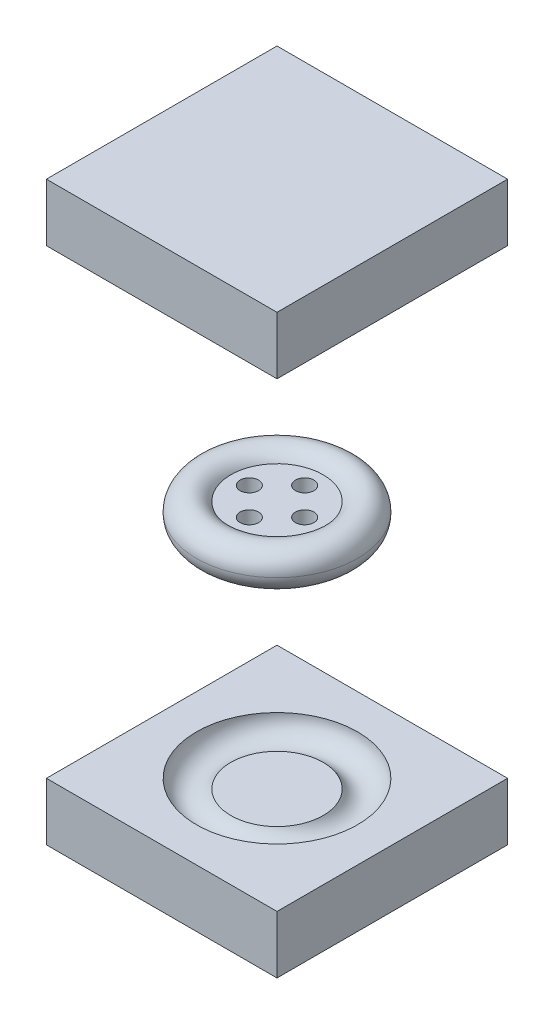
ISO-10303-21;
HEADER;
FILE_DESCRIPTION(('STEP AP214'),'2;1');
FILE_NAME('part.step','',(''),(''),'','','');
FILE_SCHEMA(('AUTOMOTIVE_DESIGN { 1 0 10303 214 1 1 1 1 }'));
ENDSEC;
DATA;
#1=APPLICATION_CONTEXT('core data for automotive mechanical design processes');
#2=APPLICATION_PROTOCOL_DEFINITION('international standard','automotive_design',2000,#1);
#3=PRODUCT_CONTEXT('',#1,'mechanical');
#4=PRODUCT('Part','Part','',(#3));
#5=PRODUCT_RELATED_PRODUCT_CATEGORY('part','',(#4));
#6=PRODUCT_DEFINITION_FORMATION('','',#4);
#7=PRODUCT_DEFINITION_CONTEXT('part definition',#1,'design');
#8=PRODUCT_DEFINITION('design','',#6,#7);
#9=PRODUCT_DEFINITION_SHAPE('','',#8);
#10=(LENGTH_UNIT() NAMED_UNIT(*) SI_UNIT(.MILLI.,.METRE.));
#11=(NAMED_UNIT(*) PLANE_ANGLE_UNIT() SI_UNIT($,.RADIAN.));
#12=(NAMED_UNIT(*) SI_UNIT($,.STERADIAN.) SOLID_ANGLE_UNIT());
#13=UNCERTAINTY_MEASURE_WITH_UNIT(LENGTH_MEASURE(1.E-05),#10,'distance_accuracy_value','');
#14=(GEOMETRIC_REPRESENTATION_CONTEXT(3) GLOBAL_UNCERTAINTY_ASSIGNED_CONTEXT((#13)) GLOBAL_UNIT_ASSIGNED_CONTEXT((#10,
#11,#12)) REPRESENTATION_CONTEXT('',''));
#15=CARTESIAN_POINT('',(0.,0.,0.));
#16=DIRECTION('',(0.,0.,1.));
#17=DIRECTION('',(1.,0.,0.));
#18=AXIS2_PLACEMENT_3D('',#15,#16,#17);
#19=CARTESIAN_POINT('',(0.,-104.,0.));
#20=DIRECTION('',(0.,1.,0.));
#21=DIRECTION('',(0.,0.,1.));
#22=AXIS2_PLACEMENT_3D('',#19,#20,#21);
#23=PLANE('',#22);
#24=CARTESIAN_POINT('',(0.,-104.,0.));
#25=DIRECTION('',(0.,-1.,0.));
#26=DIRECTION('',(0.,0.,-1.));
#27=AXIS2_PLACEMENT_3D('',#24,#25,#26);
#28=CIRCLE('',#27,20.);
#29=CARTESIAN_POINT('',(0.,-104.,-20.));
#30=VERTEX_POINT('',#29);
#31=EDGE_CURVE('E202',#30,#30,#28,.T.);
#32=ORIENTED_EDGE('',*,*,#31,.F.);
#33=EDGE_LOOP('',(#32));
#34=FACE_BOUND('',#33,.T.);
#35=ADVANCED_FACE('F129',(#34),#23,.T.);
#36=CARTESIAN_POINT('',(0.,-100.,0.));
#37=DIRECTION('',(0.,-1.,0.));
#38=DIRECTION('',(0.,0.,-1.));
#39=AXIS2_PLACEMENT_3D('',#36,#37,#38);
#40=TOROIDAL_SURFACE('',#39,26.9282032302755,8.);
#41=ORIENTED_EDGE('',*,*,#31,.T.);
#42=EDGE_LOOP('',(#41));
#43=FACE_BOUND('',#42,.T.);
#44=CARTESIAN_POINT('',(0.,-100.,0.));
#45=DIRECTION('',(0.,-1.,0.));
#46=DIRECTION('',(0.,0.,-1.));
#47=AXIS2_PLACEMENT_3D('',#44,#45,#46);
#48=CIRCLE('',#47,34.9282032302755);
#49=CARTESIAN_POINT('',(0.,-100.,-34.9282032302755));
#50=VERTEX_POINT('',#49);
#51=EDGE_CURVE('E195',#50,#50,#48,.T.);
#52=ORIENTED_EDGE('',*,*,#51,.F.);
#53=EDGE_LOOP('',(#52));
#54=FACE_BOUND('',#53,.T.);
#55=ADVANCED_FACE('F223',(#43,#54),#40,.F.);
#56=CARTESIAN_POINT('',(-0.725366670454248,-100.,-34.9282043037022));
#57=DIRECTION('',(0.,1.,0.));
#58=DIRECTION('',(0.999999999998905,0.,1.47984010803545E-06));
#59=AXIS2_PLACEMENT_3D('',#56,#57,#58);
#60=PLANE('',#59);
#61=DIRECTION('',(0.,0.,1.));
#62=VECTOR('',#61,1.);
#63=CARTESIAN_POINT('',(50.,-100.,-50.));
#64=LINE('',#63,#62);
#65=CARTESIAN_POINT('',(50.,-100.,-50.));
#66=VERTEX_POINT('',#65);
#67=CARTESIAN_POINT('',(50.,-100.,50.));
#68=VERTEX_POINT('',#67);
#69=EDGE_CURVE('E140',#66,#68,#64,.T.);
#70=ORIENTED_EDGE('',*,*,#69,.F.);
#71=DIRECTION('',(1.,0.,0.));
#72=VECTOR('',#71,1.);
#73=CARTESIAN_POINT('',(-50.,-100.,-50.));
#74=LINE('',#73,#72);
#75=CARTESIAN_POINT('',(-50.,-100.,-50.));
#76=VERTEX_POINT('',#75);
#77=EDGE_CURVE('E163',#76,#66,#74,.T.);
#78=ORIENTED_EDGE('',*,*,#77,.F.);
#79=DIRECTION('',(0.,0.,-1.));
#80=VECTOR('',#79,1.);
#81=CARTESIAN_POINT('',(-50.,-100.,-50.));
#82=LINE('',#81,#80);
#83=CARTESIAN_POINT('',(-50.,-100.,50.));
#84=VERTEX_POINT('',#83);
#85=EDGE_CURVE('E168',#84,#76,#82,.T.);
#86=ORIENTED_EDGE('',*,*,#85,.F.);
#87=DIRECTION('',(-1.,0.,0.));
#88=VECTOR('',#87,1.);
#89=CARTESIAN_POINT('',(-50.,-100.,50.));
#90=LINE('',#89,#88);
#91=EDGE_CURVE('E183',#68,#84,#90,.T.);
#92=ORIENTED_EDGE('',*,*,#91,.F.);
#93=EDGE_LOOP('',(#70,#78,#86,#92));
#94=FACE_BOUND('',#93,.T.);
#95=ORIENTED_EDGE('',*,*,#51,.T.);
#96=EDGE_LOOP('',(#95));
#97=FACE_BOUND('',#96,.T.);
#98=ADVANCED_FACE('F131',(#94,#97),#60,.T.);
#99=CARTESIAN_POINT('',(0.,-125.,0.));
#100=DIRECTION('',(0.,1.,0.));
#101=DIRECTION('',(0.,0.,1.));
#102=AXIS2_PLACEMENT_3D('',#99,#100,#101);
#103=PLANE('',#102);
#104=DIRECTION('',(0.,0.,1.));
#105=VECTOR('',#104,1.);
#106=CARTESIAN_POINT('',(50.,-125.,-50.));
#107=LINE('',#106,#105);
#108=CARTESIAN_POINT('',(50.,-125.,-50.));
#109=VERTEX_POINT('',#108);
#110=CARTESIAN_POINT('',(50.,-125.,50.));
#111=VERTEX_POINT('',#110);
#112=EDGE_CURVE('E193',#109,#111,#107,.T.);
#113=ORIENTED_EDGE('',*,*,#112,.T.);
#114=DIRECTION('',(-1.,0.,0.));
#115=VECTOR('',#114,1.);
#116=CARTESIAN_POINT('',(-50.,-125.,50.));
#117=LINE('',#116,#115);
#118=CARTESIAN_POINT('',(-50.,-125.,50.));
#119=VERTEX_POINT('',#118);
#120=EDGE_CURVE('E181',#111,#119,#117,.T.);
#121=ORIENTED_EDGE('',*,*,#120,.T.);
#122=DIRECTION('',(0.,0.,-1.));
#123=VECTOR('',#122,1.);
#124=CARTESIAN_POINT('',(-50.,-125.,-50.));
#125=LINE('',#124,#123);
#126=CARTESIAN_POINT('',(-50.,-125.,-50.));
#127=VERTEX_POINT('',#126);
#128=EDGE_CURVE('E185',#119,#127,#125,.T.);
#129=ORIENTED_EDGE('',*,*,#128,.T.);
#130=DIRECTION('',(1.,0.,0.));
#131=VECTOR('',#130,1.);
#132=CARTESIAN_POINT('',(-50.,-125.,-50.));
#133=LINE('',#132,#131);
#134=EDGE_CURVE('E190',#127,#109,#133,.T.);
#135=ORIENTED_EDGE('',*,*,#134,.T.);
#136=EDGE_LOOP('',(#113,#121,#129,#135));
#137=FACE_BOUND('',#136,.T.);
#138=ADVANCED_FACE('F192',(#137),#103,.F.);
#139=CARTESIAN_POINT('',(-50.,-75.,50.));
#140=DIRECTION('',(0.,0.,1.));
#141=DIRECTION('',(1.,0.,0.));
#142=AXIS2_PLACEMENT_3D('',#139,#140,#141);
#143=PLANE('',#142);
#144=DIRECTION('',(0.,-1.,0.));
#145=VECTOR('',#144,1.);
#146=CARTESIAN_POINT('',(50.,-75.,50.));
#147=LINE('',#146,#145);
#148=EDGE_CURVE('E14',#68,#111,#147,.T.);
#149=ORIENTED_EDGE('',*,*,#148,.F.);
#150=ORIENTED_EDGE('',*,*,#91,.T.);
#151=DIRECTION('',(0.,-1.,0.));
#152=VECTOR('',#151,1.);
#153=CARTESIAN_POINT('',(-50.,-75.,50.));
#154=LINE('',#153,#152);
#155=EDGE_CURVE('E178',#84,#119,#154,.T.);
#156=ORIENTED_EDGE('',*,*,#155,.T.);
#157=ORIENTED_EDGE('',*,*,#120,.F.);
#158=EDGE_LOOP('',(#149,#150,#156,#157));
#159=FACE_BOUND('',#158,.T.);
#160=ADVANCED_FACE('F179',(#159),#143,.T.);
#161=CARTESIAN_POINT('',(-50.,-75.,-50.));
#162=DIRECTION('',(-1.,0.,0.));
#163=DIRECTION('',(0.,0.,1.));
#164=AXIS2_PLACEMENT_3D('',#161,#162,#163);
#165=PLANE('',#164);
#166=ORIENTED_EDGE('',*,*,#155,.F.);
#167=ORIENTED_EDGE('',*,*,#85,.T.);
#168=DIRECTION('',(0.,-1.,0.));
#169=VECTOR('',#168,1.);
#170=CARTESIAN_POINT('',(-50.,-75.,-50.));
#171=LINE('',#170,#169);
#172=EDGE_CURVE('E173',#76,#127,#171,.T.);
#173=ORIENTED_EDGE('',*,*,#172,.T.);
#174=ORIENTED_EDGE('',*,*,#128,.F.);
#175=EDGE_LOOP('',(#166,#167,#173,#174));
#176=FACE_BOUND('',#175,.T.);
#177=ADVANCED_FACE('F186',(#176),#165,.T.);
#178=CARTESIAN_POINT('',(-50.,-75.,-50.));
#179=DIRECTION('',(0.,0.,-1.));
#180=DIRECTION('',(-1.,0.,0.));
#181=AXIS2_PLACEMENT_3D('',#178,#179,#180);
#182=PLANE('',#181);
#183=ORIENTED_EDGE('',*,*,#172,.F.);
#184=ORIENTED_EDGE('',*,*,#77,.T.);
#185=DIRECTION('',(0.,-1.,0.));
#186=VECTOR('',#185,1.);
#187=CARTESIAN_POINT('',(50.,-75.,-50.));
#188=LINE('',#187,#186);
#189=EDGE_CURVE('E207',#66,#109,#188,.T.);
#190=ORIENTED_EDGE('',*,*,#189,.T.);
#191=ORIENTED_EDGE('',*,*,#134,.F.);
#192=EDGE_LOOP('',(#183,#184,#190,#191));
#193=FACE_BOUND('',#192,.T.);
#194=ADVANCED_FACE('F213',(#193),#182,.T.);
#195=CARTESIAN_POINT('',(50.,-75.,-50.));
#196=DIRECTION('',(1.,0.,0.));
#197=DIRECTION('',(0.,0.,-1.));
#198=AXIS2_PLACEMENT_3D('',#195,#196,#197);
#199=PLANE('',#198);
#200=ORIENTED_EDGE('',*,*,#189,.F.);
#201=ORIENTED_EDGE('',*,*,#69,.T.);
#202=ORIENTED_EDGE('',*,*,#148,.T.);
#203=ORIENTED_EDGE('',*,*,#112,.F.);
#204=EDGE_LOOP('',(#200,#201,#202,#203));
#205=FACE_BOUND('',#204,.T.);
#206=ADVANCED_FACE('F214',(#205),#199,.T.);
#207=CLOSED_SHELL('',(#35,#55,#98,#138,#160,#177,#194,#206));
#208=MANIFOLD_SOLID_BREP('B2',#207);
#209=CARTESIAN_POINT('',(0.,0.,0.));
#210=DIRECTION('',(0.,-1.,0.));
#211=DIRECTION('',(0.,0.,-1.));
#212=AXIS2_PLACEMENT_3D('',#209,#210,#211);
#213=TOROIDAL_SURFACE('',#212,26.9282032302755,8.);
#214=CARTESIAN_POINT('',(0.,-4.,0.));
#215=DIRECTION('',(0.,-1.,0.));
#216=DIRECTION('',(0.,0.,-1.));
#217=AXIS2_PLACEMENT_3D('',#214,#215,#216);
#218=CIRCLE('',#217,20.);
#219=CARTESIAN_POINT('',(0.,-4.,-20.));
#220=VERTEX_POINT('',#219);
#221=EDGE_CURVE('E358',#220,#220,#218,.T.);
#222=ORIENTED_EDGE('',*,*,#221,.F.);
#223=EDGE_LOOP('',(#222));
#224=FACE_BOUND('',#223,.T.);
#225=CARTESIAN_POINT('',(0.,0.,0.));
#226=DIRECTION('',(0.,-1.,0.));
#227=DIRECTION('',(0.,0.,-1.));
#228=AXIS2_PLACEMENT_3D('',#225,#226,#227);
#229=CIRCLE('',#228,34.9282032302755);
#230=CARTESIAN_POINT('',(0.,0.,-34.9282032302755));
#231=VERTEX_POINT('',#230);
#232=EDGE_CURVE('E128',#231,#231,#229,.T.);
#233=ORIENTED_EDGE('',*,*,#232,.T.);
#234=EDGE_LOOP('',(#233));
#235=FACE_BOUND('',#234,.T.);
#236=ADVANCED_FACE('F351',(#224,#235),#213,.T.);
#237=CARTESIAN_POINT('',(0.,4.,0.));
#238=DIRECTION('',(0.,1.,0.));
#239=DIRECTION('',(0.,0.,1.));
#240=AXIS2_PLACEMENT_3D('',#237,#238,#239);
#241=PLANE('',#240);
#242=CARTESIAN_POINT('',(12.,4.,0.));
#243=DIRECTION('',(0.,1.,0.));
#244=DIRECTION('',(0.,0.,1.));
#245=AXIS2_PLACEMENT_3D('',#242,#243,#244);
#246=CIRCLE('',#245,4.);
#247=CARTESIAN_POINT('',(12.,4.,4.));
#248=VERTEX_POINT('',#247);
#249=EDGE_CURVE('E375',#248,#248,#246,.T.);
#250=ORIENTED_EDGE('',*,*,#249,.F.);
#251=EDGE_LOOP('',(#250));
#252=FACE_BOUND('',#251,.T.);
#253=CARTESIAN_POINT('',(0.,4.,12.));
#254=DIRECTION('',(0.,1.,0.));
#255=DIRECTION('',(0.,0.,1.));
#256=AXIS2_PLACEMENT_3D('',#253,#254,#255);
#257=CIRCLE('',#256,4.);
#258=CARTESIAN_POINT('',(0.,4.,16.));
#259=VERTEX_POINT('',#258);
#260=EDGE_CURVE('E407',#259,#259,#257,.T.);
#261=ORIENTED_EDGE('',*,*,#260,.F.);
#262=EDGE_LOOP('',(#261));
#263=FACE_BOUND('',#262,.T.);
#264=CARTESIAN_POINT('',(-12.,4.,0.));
#265=DIRECTION('',(0.,1.,0.));
#266=DIRECTION('',(0.,0.,1.));
#267=AXIS2_PLACEMENT_3D('',#264,#265,#266);
#268=CIRCLE('',#267,4.);
#269=CARTESIAN_POINT('',(-12.,4.,3.99999999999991));
#270=VERTEX_POINT('',#269);
#271=EDGE_CURVE('E405',#270,#270,#268,.T.);
#272=ORIENTED_EDGE('',*,*,#271,.F.);
#273=EDGE_LOOP('',(#272));
#274=FACE_BOUND('',#273,.T.);
#275=CARTESIAN_POINT('',(1.25693328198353E-13,4.,-12.));
#276=DIRECTION('',(0.,1.,0.));
#277=DIRECTION('',(0.,0.,1.));
#278=AXIS2_PLACEMENT_3D('',#275,#276,#277);
#279=CIRCLE('',#278,4.);
#280=CARTESIAN_POINT('',(1.25693328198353E-13,4.,-8.));
#281=VERTEX_POINT('',#280);
#282=EDGE_CURVE('E403',#281,#281,#279,.T.);
#283=ORIENTED_EDGE('',*,*,#282,.F.);
#284=EDGE_LOOP('',(#283));
#285=FACE_BOUND('',#284,.T.);
#286=CARTESIAN_POINT('',(0.,4.,0.));
#287=DIRECTION('',(0.,-1.,0.));
#288=DIRECTION('',(0.,0.,-1.));
#289=AXIS2_PLACEMENT_3D('',#286,#287,#288);
#290=CIRCLE('',#289,20.);
#291=CARTESIAN_POINT('',(0.,4.,-20.));
#292=VERTEX_POINT('',#291);
#293=EDGE_CURVE('E362',#292,#292,#290,.T.);
#294=ORIENTED_EDGE('',*,*,#293,.F.);
#295=EDGE_LOOP('',(#294));
#296=FACE_BOUND('',#295,.T.);
#297=ADVANCED_FACE('F353',(#252,#263,#274,#285,#296),#241,.T.);
#298=CARTESIAN_POINT('',(0.,-4.,0.));
#299=DIRECTION('',(0.,-1.,0.));
#300=DIRECTION('',(0.,0.,-1.));
#301=AXIS2_PLACEMENT_3D('',#298,#299,#300);
#302=PLANE('',#301);
#303=CARTESIAN_POINT('',(12.,-4.,0.));
#304=DIRECTION('',(0.,-1.,0.));
#305=DIRECTION('',(0.,0.,-1.));
#306=AXIS2_PLACEMENT_3D('',#303,#304,#305);
#307=CIRCLE('',#306,3.72063384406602);
#308=CARTESIAN_POINT('',(12.,-4.,-3.72063384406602));
#309=VERTEX_POINT('',#308);
#310=EDGE_CURVE('E367',#309,#309,#307,.T.);
#311=ORIENTED_EDGE('',*,*,#310,.F.);
#312=EDGE_LOOP('',(#311));
#313=FACE_BOUND('',#312,.T.);
#314=CARTESIAN_POINT('',(0.,-4.,12.));
#315=DIRECTION('',(0.,-1.,0.));
#316=DIRECTION('',(0.,0.,-1.));
#317=AXIS2_PLACEMENT_3D('',#314,#315,#316);
#318=CIRCLE('',#317,3.72063384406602);
#319=CARTESIAN_POINT('',(0.,-4.,8.27936615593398));
#320=VERTEX_POINT('',#319);
#321=EDGE_CURVE('E378',#320,#320,#318,.T.);
#322=ORIENTED_EDGE('',*,*,#321,.F.);
#323=EDGE_LOOP('',(#322));
#324=FACE_BOUND('',#323,.T.);
#325=CARTESIAN_POINT('',(-12.,-4.,0.));
#326=DIRECTION('',(0.,-1.,0.));
#327=DIRECTION('',(0.,0.,-1.));
#328=AXIS2_PLACEMENT_3D('',#325,#326,#327);
#329=CIRCLE('',#328,3.72063384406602);
#330=CARTESIAN_POINT('',(-12.,-4.,-3.7206338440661));
#331=VERTEX_POINT('',#330);
#332=EDGE_CURVE('E374',#331,#331,#329,.T.);
#333=ORIENTED_EDGE('',*,*,#332,.F.);
#334=EDGE_LOOP('',(#333));
#335=FACE_BOUND('',#334,.T.);
#336=CARTESIAN_POINT('',(1.25693328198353E-13,-4.,-12.));
#337=DIRECTION('',(0.,-1.,0.));
#338=DIRECTION('',(0.,0.,-1.));
#339=AXIS2_PLACEMENT_3D('',#336,#337,#338);
#340=CIRCLE('',#339,3.72063384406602);
#341=CARTESIAN_POINT('',(1.25693328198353E-13,-4.,-15.720633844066));
#342=VERTEX_POINT('',#341);
#343=EDGE_CURVE('E371',#342,#342,#340,.T.);
#344=ORIENTED_EDGE('',*,*,#343,.F.);
#345=EDGE_LOOP('',(#344));
#346=FACE_BOUND('',#345,.T.);
#347=ORIENTED_EDGE('',*,*,#221,.T.);
#348=EDGE_LOOP('',(#347));
#349=FACE_BOUND('',#348,.T.);
#350=ADVANCED_FACE('F386',(#313,#324,#335,#346,#349),#302,.T.);
#351=ORIENTED_EDGE('',*,*,#232,.F.);
#352=EDGE_LOOP('',(#351));
#353=FACE_BOUND('',#352,.T.);
#354=ORIENTED_EDGE('',*,*,#293,.T.);
#355=EDGE_LOOP('',(#354));
#356=FACE_BOUND('',#355,.T.);
#357=ADVANCED_FACE('F389',(#353,#356),#213,.T.);
#358=CARTESIAN_POINT('',(1.25693328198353E-13,4.,-12.));
#359=DIRECTION('',(0.,1.,0.));
#360=DIRECTION('',(0.,0.,1.));
#361=AXIS2_PLACEMENT_3D('',#358,#359,#360);
#362=CONICAL_SURFACE('',#361,4.,0.0349065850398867);
#363=ORIENTED_EDGE('',*,*,#343,.T.);
#364=EDGE_LOOP('',(#363));
#365=FACE_BOUND('',#364,.T.);
#366=ORIENTED_EDGE('',*,*,#282,.T.);
#367=EDGE_LOOP('',(#366));
#368=FACE_BOUND('',#367,.T.);
#369=ADVANCED_FACE('F396',(#365,#368),#362,.F.);
#370=CARTESIAN_POINT('',(-12.,4.,0.));
#371=DIRECTION('',(0.,1.,0.));
#372=DIRECTION('',(0.,0.,1.));
#373=AXIS2_PLACEMENT_3D('',#370,#371,#372);
#374=CONICAL_SURFACE('',#373,4.,0.0349065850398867);
#375=ORIENTED_EDGE('',*,*,#332,.T.);
#376=EDGE_LOOP('',(#375));
#377=FACE_BOUND('',#376,.T.);
#378=ORIENTED_EDGE('',*,*,#271,.T.);
#379=EDGE_LOOP('',(#378));
#380=FACE_BOUND('',#379,.T.);
#381=ADVANCED_FACE('F399',(#377,#380),#374,.F.);
#382=CARTESIAN_POINT('',(0.,4.,12.));
#383=DIRECTION('',(0.,1.,0.));
#384=DIRECTION('',(0.,0.,1.));
#385=AXIS2_PLACEMENT_3D('',#382,#383,#384);
#386=CONICAL_SURFACE('',#385,4.,0.0349065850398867);
#387=ORIENTED_EDGE('',*,*,#321,.T.);
#388=EDGE_LOOP('',(#387));
#389=FACE_BOUND('',#388,.T.);
#390=ORIENTED_EDGE('',*,*,#260,.T.);
#391=EDGE_LOOP('',(#390));
#392=FACE_BOUND('',#391,.T.);
#393=ADVANCED_FACE('F479',(#389,#392),#386,.F.);
#394=CARTESIAN_POINT('',(12.,4.,0.));
#395=DIRECTION('',(0.,1.,0.));
#396=DIRECTION('',(0.,0.,1.));
#397=AXIS2_PLACEMENT_3D('',#394,#395,#396);
#398=CONICAL_SURFACE('',#397,4.,0.0349065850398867);
#399=ORIENTED_EDGE('',*,*,#310,.T.);
#400=EDGE_LOOP('',(#399));
#401=FACE_BOUND('',#400,.T.);
#402=ORIENTED_EDGE('',*,*,#249,.T.);
#403=EDGE_LOOP('',(#402));
#404=FACE_BOUND('',#403,.T.);
#405=ADVANCED_FACE('F383',(#401,#404),#398,.F.);
#406=CLOSED_SHELL('',(#236,#297,#350,#357,#369,#381,#393,#405));
#407=MANIFOLD_SOLID_BREP('B8',#406);
#408=CARTESIAN_POINT('',(50.,125.,-50.));
#409=DIRECTION('',(1.,0.,0.));
#410=DIRECTION('',(0.,0.,-1.));
#411=AXIS2_PLACEMENT_3D('',#408,#409,#410);
#412=PLANE('',#411);
#413=DIRECTION('',(0.,0.,1.));
#414=VECTOR('',#413,1.);
#415=CARTESIAN_POINT('',(50.,100.,-50.));
#416=LINE('',#415,#414);
#417=CARTESIAN_POINT('',(50.,100.,-50.));
#418=VERTEX_POINT('',#417);
#419=CARTESIAN_POINT('',(50.,100.,50.));
#420=VERTEX_POINT('',#419);
#421=EDGE_CURVE('E609',#418,#420,#416,.T.);
#422=ORIENTED_EDGE('',*,*,#421,.F.);
#423=DIRECTION('',(0.,-1.,0.));
#424=VECTOR('',#423,1.);
#425=CARTESIAN_POINT('',(50.,125.,-50.));
#426=LINE('',#425,#424);
#427=CARTESIAN_POINT('',(50.,125.,-50.));
#428=VERTEX_POINT('',#427);
#429=EDGE_CURVE('E606',#428,#418,#426,.T.);
#430=ORIENTED_EDGE('',*,*,#429,.F.);
#431=DIRECTION('',(0.,0.,1.));
#432=VECTOR('',#431,1.);
#433=CARTESIAN_POINT('',(50.,125.,-50.));
#434=LINE('',#433,#432);
#435=CARTESIAN_POINT('',(50.,125.,50.));
#436=VERTEX_POINT('',#435);
#437=EDGE_CURVE('E600',#428,#436,#434,.T.);
#438=ORIENTED_EDGE('',*,*,#437,.T.);
#439=DIRECTION('',(0.,-1.,0.));
#440=VECTOR('',#439,1.);
#441=CARTESIAN_POINT('',(50.,125.,50.));
#442=LINE('',#441,#440);
#443=EDGE_CURVE('E585',#436,#420,#442,.T.);
#444=ORIENTED_EDGE('',*,*,#443,.T.);
#445=EDGE_LOOP('',(#422,#430,#438,#444));
#446=FACE_BOUND('',#445,.T.);
#447=ADVANCED_FACE('F545',(#446),#412,.T.);
#448=CARTESIAN_POINT('',(-50.,125.,-50.));
#449=DIRECTION('',(0.,0.,-1.));
#450=DIRECTION('',(-1.,0.,0.));
#451=AXIS2_PLACEMENT_3D('',#448,#449,#450);
#452=PLANE('',#451);
#453=DIRECTION('',(1.,0.,0.));
#454=VECTOR('',#453,1.);
#455=CARTESIAN_POINT('',(-50.,100.,-50.));
#456=LINE('',#455,#454);
#457=CARTESIAN_POINT('',(-50.,100.,-50.));
#458=VERTEX_POINT('',#457);
#459=EDGE_CURVE('E620',#458,#418,#456,.T.);
#460=ORIENTED_EDGE('',*,*,#459,.F.);
#461=DIRECTION('',(0.,-1.,0.));
#462=VECTOR('',#461,1.);
#463=CARTESIAN_POINT('',(-50.,125.,-50.));
#464=LINE('',#463,#462);
#465=CARTESIAN_POINT('',(-50.,125.,-50.));
#466=VERTEX_POINT('',#465);
#467=EDGE_CURVE('E615',#466,#458,#464,.T.);
#468=ORIENTED_EDGE('',*,*,#467,.F.);
#469=DIRECTION('',(1.,0.,0.));
#470=VECTOR('',#469,1.);
#471=CARTESIAN_POINT('',(-50.,125.,-50.));
#472=LINE('',#471,#470);
#473=EDGE_CURVE('E594',#466,#428,#472,.T.);
#474=ORIENTED_EDGE('',*,*,#473,.T.);
#475=ORIENTED_EDGE('',*,*,#429,.T.);
#476=EDGE_LOOP('',(#460,#468,#474,#475));
#477=FACE_BOUND('',#476,.T.);
#478=ADVANCED_FACE('F662',(#477),#452,.T.);
#479=CARTESIAN_POINT('',(-50.,125.,-50.));
#480=DIRECTION('',(-1.,0.,0.));
#481=DIRECTION('',(0.,0.,1.));
#482=AXIS2_PLACEMENT_3D('',#479,#480,#481);
#483=PLANE('',#482);
#484=DIRECTION('',(0.,0.,-1.));
#485=VECTOR('',#484,1.);
#486=CARTESIAN_POINT('',(-50.,100.,-50.));
#487=LINE('',#486,#485);
#488=CARTESIAN_POINT('',(-50.,100.,50.));
#489=VERTEX_POINT('',#488);
#490=EDGE_CURVE('E562',#489,#458,#487,.T.);
#491=ORIENTED_EDGE('',*,*,#490,.F.);
#492=DIRECTION('',(0.,-1.,0.));
#493=VECTOR('',#492,1.);
#494=CARTESIAN_POINT('',(-50.,125.,50.));
#495=LINE('',#494,#493);
#496=CARTESIAN_POINT('',(-50.,125.,50.));
#497=VERTEX_POINT('',#496);
#498=EDGE_CURVE('E593',#497,#489,#495,.T.);
#499=ORIENTED_EDGE('',*,*,#498,.F.);
#500=DIRECTION('',(0.,0.,-1.));
#501=VECTOR('',#500,1.);
#502=CARTESIAN_POINT('',(-50.,125.,-50.));
#503=LINE('',#502,#501);
#504=EDGE_CURVE('E603',#497,#466,#503,.T.);
#505=ORIENTED_EDGE('',*,*,#504,.T.);
#506=ORIENTED_EDGE('',*,*,#467,.T.);
#507=EDGE_LOOP('',(#491,#499,#505,#506));
#508=FACE_BOUND('',#507,.T.);
#509=ADVANCED_FACE('F619',(#508),#483,.T.);
#510=CARTESIAN_POINT('',(-50.,125.,50.));
#511=DIRECTION('',(0.,0.,1.));
#512=DIRECTION('',(1.,0.,0.));
#513=AXIS2_PLACEMENT_3D('',#510,#511,#512);
#514=PLANE('',#513);
#515=DIRECTION('',(-1.,0.,0.));
#516=VECTOR('',#515,1.);
#517=CARTESIAN_POINT('',(-50.,100.,50.));
#518=LINE('',#517,#516);
#519=EDGE_CURVE('E548',#420,#489,#518,.T.);
#520=ORIENTED_EDGE('',*,*,#519,.F.);
#521=ORIENTED_EDGE('',*,*,#443,.F.);
#522=DIRECTION('',(-1.,0.,0.));
#523=VECTOR('',#522,1.);
#524=CARTESIAN_POINT('',(-50.,125.,50.));
#525=LINE('',#524,#523);
#526=EDGE_CURVE('E589',#436,#497,#525,.T.);
#527=ORIENTED_EDGE('',*,*,#526,.T.);
#528=ORIENTED_EDGE('',*,*,#498,.T.);
#529=EDGE_LOOP('',(#520,#521,#527,#528));
#530=FACE_BOUND('',#529,.T.);
#531=ADVANCED_FACE('F587',(#530),#514,.T.);
#532=CARTESIAN_POINT('',(0.,125.,0.));
#533=DIRECTION('',(0.,1.,0.));
#534=DIRECTION('',(0.,0.,1.));
#535=AXIS2_PLACEMENT_3D('',#532,#533,#534);
#536=PLANE('',#535);
#537=ORIENTED_EDGE('',*,*,#437,.F.);
#538=ORIENTED_EDGE('',*,*,#473,.F.);
#539=ORIENTED_EDGE('',*,*,#504,.F.);
#540=ORIENTED_EDGE('',*,*,#526,.F.);
#541=EDGE_LOOP('',(#537,#538,#539,#540));
#542=FACE_BOUND('',#541,.T.);
#543=ADVANCED_FACE('F598',(#542),#536,.T.);
#544=CARTESIAN_POINT('',(0.,96.,0.));
#545=DIRECTION('',(0.,1.,0.));
#546=DIRECTION('',(0.,0.,1.));
#547=AXIS2_PLACEMENT_3D('',#544,#545,#546);
#548=PLANE('',#547);
#549=CARTESIAN_POINT('',(-12.,96.,0.));
#550=DIRECTION('',(0.,1.,0.));
#551=DIRECTION('',(0.,0.,1.));
#552=AXIS2_PLACEMENT_3D('',#549,#550,#551);
#553=CIRCLE('',#552,3.72063384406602);
#554=CARTESIAN_POINT('',(-12.,96.,3.72063384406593));
#555=VERTEX_POINT('',#554);
#556=EDGE_CURVE('E630',#555,#555,#553,.F.);
#557=ORIENTED_EDGE('',*,*,#556,.T.);
#558=EDGE_LOOP('',(#557));
#559=FACE_BOUND('',#558,.T.);
#560=ADVANCED_FACE('F676',(#559),#548,.F.);
#561=CARTESIAN_POINT('',(1.25693328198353E-13,104.,-12.));
#562=DIRECTION('',(0.,1.,0.));
#563=DIRECTION('',(0.,0.,1.));
#564=AXIS2_PLACEMENT_3D('',#561,#562,#563);
#565=CONICAL_SURFACE('',#564,4.,0.0349065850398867);
#566=CARTESIAN_POINT('',(1.25693328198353E-13,96.,-12.));
#567=DIRECTION('',(0.,-1.,0.));
#568=DIRECTION('',(0.,0.,-1.));
#569=AXIS2_PLACEMENT_3D('',#566,#567,#568);
#570=CIRCLE('',#569,3.72063384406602);
#571=CARTESIAN_POINT('',(1.25693328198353E-13,96.,-15.720633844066));
#572=VERTEX_POINT('',#571);
#573=EDGE_CURVE('E625',#572,#572,#570,.T.);
#574=ORIENTED_EDGE('',*,*,#573,.F.);
#575=EDGE_LOOP('',(#574));
#576=FACE_BOUND('',#575,.T.);
#577=CARTESIAN_POINT('',(1.25693328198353E-13,104.,-12.));
#578=DIRECTION('',(0.,1.,0.));
#579=DIRECTION('',(0.,0.,1.));
#580=AXIS2_PLACEMENT_3D('',#577,#578,#579);
#581=CIRCLE('',#580,4.);
#582=CARTESIAN_POINT('',(1.25693328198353E-13,104.,-8.));
#583=VERTEX_POINT('',#582);
#584=EDGE_CURVE('E629',#583,#583,#581,.T.);
#585=ORIENTED_EDGE('',*,*,#584,.F.);
#586=EDGE_LOOP('',(#585));
#587=FACE_BOUND('',#586,.T.);
#588=ADVANCED_FACE('F680',(#576,#587),#565,.T.);
#589=CARTESIAN_POINT('',(-12.,104.,0.));
#590=DIRECTION('',(0.,1.,0.));
#591=DIRECTION('',(0.,0.,1.));
#592=AXIS2_PLACEMENT_3D('',#589,#590,#591);
#593=CONICAL_SURFACE('',#592,4.,0.0349065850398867);
#594=ORIENTED_EDGE('',*,*,#556,.F.);
#595=EDGE_LOOP('',(#594));
#596=FACE_BOUND('',#595,.T.);
#597=CARTESIAN_POINT('',(-12.,104.,0.));
#598=DIRECTION('',(0.,1.,0.));
#599=DIRECTION('',(0.,0.,1.));
#600=AXIS2_PLACEMENT_3D('',#597,#598,#599);
#601=CIRCLE('',#600,4.);
#602=CARTESIAN_POINT('',(-12.,104.,3.99999999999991));
#603=VERTEX_POINT('',#602);
#604=EDGE_CURVE('E636',#603,#603,#601,.T.);
#605=ORIENTED_EDGE('',*,*,#604,.F.);
#606=EDGE_LOOP('',(#605));
#607=FACE_BOUND('',#606,.T.);
#608=ADVANCED_FACE('F685',(#596,#607),#593,.T.);
#609=CARTESIAN_POINT('',(0.,104.,12.));
#610=DIRECTION('',(0.,1.,0.));
#611=DIRECTION('',(0.,0.,1.));
#612=AXIS2_PLACEMENT_3D('',#609,#610,#611);
#613=CONICAL_SURFACE('',#612,4.,0.0349065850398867);
#614=CARTESIAN_POINT('',(0.,96.,12.));
#615=DIRECTION('',(0.,-1.,0.));
#616=DIRECTION('',(0.,0.,-1.));
#617=AXIS2_PLACEMENT_3D('',#614,#615,#616);
#618=CIRCLE('',#617,3.72063384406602);
#619=CARTESIAN_POINT('',(0.,96.,8.27936615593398));
#620=VERTEX_POINT('',#619);
#621=EDGE_CURVE('E631',#620,#620,#618,.T.);
#622=ORIENTED_EDGE('',*,*,#621,.F.);
#623=EDGE_LOOP('',(#622));
#624=FACE_BOUND('',#623,.T.);
#625=CARTESIAN_POINT('',(0.,104.,12.));
#626=DIRECTION('',(0.,1.,0.));
#627=DIRECTION('',(0.,0.,1.));
#628=AXIS2_PLACEMENT_3D('',#625,#626,#627);
#629=CIRCLE('',#628,4.);
#630=CARTESIAN_POINT('',(0.,104.,16.));
#631=VERTEX_POINT('',#630);
#632=EDGE_CURVE('E635',#631,#631,#629,.T.);
#633=ORIENTED_EDGE('',*,*,#632,.F.);
#634=EDGE_LOOP('',(#633));
#635=FACE_BOUND('',#634,.T.);
#636=ADVANCED_FACE('F701',(#624,#635),#613,.T.);
#637=CARTESIAN_POINT('',(12.,104.,0.));
#638=DIRECTION('',(0.,1.,0.));
#639=DIRECTION('',(0.,0.,1.));
#640=AXIS2_PLACEMENT_3D('',#637,#638,#639);
#641=CONICAL_SURFACE('',#640,4.,0.0349065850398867);
#642=CARTESIAN_POINT('',(12.,96.,0.));
#643=DIRECTION('',(0.,-1.,0.));
#644=DIRECTION('',(0.,0.,-1.));
#645=AXIS2_PLACEMENT_3D('',#642,#643,#644);
#646=CIRCLE('',#645,3.72063384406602);
#647=CARTESIAN_POINT('',(12.,96.,-3.72063384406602));
#648=VERTEX_POINT('',#647);
#649=EDGE_CURVE('E637',#648,#648,#646,.T.);
#650=ORIENTED_EDGE('',*,*,#649,.F.);
#651=EDGE_LOOP('',(#650));
#652=FACE_BOUND('',#651,.T.);
#653=CARTESIAN_POINT('',(12.,104.,0.));
#654=DIRECTION('',(0.,1.,0.));
#655=DIRECTION('',(0.,0.,1.));
#656=AXIS2_PLACEMENT_3D('',#653,#654,#655);
#657=CIRCLE('',#656,4.);
#658=CARTESIAN_POINT('',(12.,104.,4.));
#659=VERTEX_POINT('',#658);
#660=EDGE_CURVE('E641',#659,#659,#657,.T.);
#661=ORIENTED_EDGE('',*,*,#660,.F.);
#662=EDGE_LOOP('',(#661));
#663=FACE_BOUND('',#662,.T.);
#664=ADVANCED_FACE('F697',(#652,#663),#641,.T.);
#665=CARTESIAN_POINT('',(0.,104.,0.));
#666=DIRECTION('',(0.,1.,0.));
#667=DIRECTION('',(0.,0.,1.));
#668=AXIS2_PLACEMENT_3D('',#665,#666,#667);
#669=PLANE('',#668);
#670=ORIENTED_EDGE('',*,*,#660,.T.);
#671=EDGE_LOOP('',(#670));
#672=FACE_BOUND('',#671,.T.);
#673=ORIENTED_EDGE('',*,*,#632,.T.);
#674=EDGE_LOOP('',(#673));
#675=FACE_BOUND('',#674,.T.);
#676=ORIENTED_EDGE('',*,*,#604,.T.);
#677=EDGE_LOOP('',(#676));
#678=FACE_BOUND('',#677,.T.);
#679=ORIENTED_EDGE('',*,*,#584,.T.);
#680=EDGE_LOOP('',(#679));
#681=FACE_BOUND('',#680,.T.);
#682=CARTESIAN_POINT('',(0.,104.,0.));
#683=DIRECTION('',(0.,-1.,0.));
#684=DIRECTION('',(0.,0.,-1.));
#685=AXIS2_PLACEMENT_3D('',#682,#683,#684);
#686=CIRCLE('',#685,20.);
#687=CARTESIAN_POINT('',(0.,104.,-20.));
#688=VERTEX_POINT('',#687);
#689=EDGE_CURVE('E554',#688,#688,#686,.T.);
#690=ORIENTED_EDGE('',*,*,#689,.T.);
#691=EDGE_LOOP('',(#690));
#692=FACE_BOUND('',#691,.T.);
#693=ADVANCED_FACE('F693',(#672,#675,#678,#681,#692),#669,.F.);
#694=CARTESIAN_POINT('',(0.,100.,0.));
#695=DIRECTION('',(0.,-1.,0.));
#696=DIRECTION('',(0.,0.,-1.));
#697=AXIS2_PLACEMENT_3D('',#694,#695,#696);
#698=TOROIDAL_SURFACE('',#697,26.9282032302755,8.);
#699=CARTESIAN_POINT('',(0.,100.,0.));
#700=DIRECTION('',(0.,-1.,0.));
#701=DIRECTION('',(0.,0.,-1.));
#702=AXIS2_PLACEMENT_3D('',#699,#700,#701);
#703=CIRCLE('',#702,34.9282032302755);
#704=CARTESIAN_POINT('',(0.,100.,-34.9282032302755));
#705=VERTEX_POINT('',#704);
#706=EDGE_CURVE('E349',#705,#705,#703,.T.);
#707=ORIENTED_EDGE('',*,*,#706,.T.);
#708=EDGE_LOOP('',(#707));
#709=FACE_BOUND('',#708,.T.);
#710=ORIENTED_EDGE('',*,*,#689,.F.);
#711=EDGE_LOOP('',(#710));
#712=FACE_BOUND('',#711,.T.);
#713=ADVANCED_FACE('F689',(#709,#712),#698,.F.);
#714=CARTESIAN_POINT('',(0.,96.,0.));
#715=DIRECTION('',(0.,1.,0.));
#716=DIRECTION('',(0.,0.,1.));
#717=AXIS2_PLACEMENT_3D('',#714,#715,#716);
#718=PLANE('',#717);
#719=ORIENTED_EDGE('',*,*,#573,.T.);
#720=EDGE_LOOP('',(#719));
#721=FACE_BOUND('',#720,.T.);
#722=ADVANCED_FACE('F692',(#721),#718,.F.);
#723=CARTESIAN_POINT('',(0.,96.,0.));
#724=DIRECTION('',(0.,1.,0.));
#725=DIRECTION('',(0.,0.,1.));
#726=AXIS2_PLACEMENT_3D('',#723,#724,#725);
#727=PLANE('',#726);
#728=ORIENTED_EDGE('',*,*,#621,.T.);
#729=EDGE_LOOP('',(#728));
#730=FACE_BOUND('',#729,.T.);
#731=ADVANCED_FACE('F711',(#730),#727,.F.);
#732=CARTESIAN_POINT('',(0.,96.,0.));
#733=DIRECTION('',(0.,1.,0.));
#734=DIRECTION('',(0.,0.,1.));
#735=AXIS2_PLACEMENT_3D('',#732,#733,#734);
#736=PLANE('',#735);
#737=ORIENTED_EDGE('',*,*,#649,.T.);
#738=EDGE_LOOP('',(#737));
#739=FACE_BOUND('',#738,.T.);
#740=ADVANCED_FACE('F715',(#739),#736,.F.);
#741=CARTESIAN_POINT('',(-0.725366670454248,100.,-34.9282043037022));
#742=DIRECTION('',(0.,1.,0.));
#743=DIRECTION('',(0.999999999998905,0.,1.47984010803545E-06));
#744=AXIS2_PLACEMENT_3D('',#741,#742,#743);
#745=PLANE('',#744);
#746=ORIENTED_EDGE('',*,*,#421,.T.);
#747=ORIENTED_EDGE('',*,*,#519,.T.);
#748=ORIENTED_EDGE('',*,*,#490,.T.);
#749=ORIENTED_EDGE('',*,*,#459,.T.);
#750=EDGE_LOOP('',(#746,#747,#748,#749));
#751=FACE_BOUND('',#750,.T.);
#752=ORIENTED_EDGE('',*,*,#706,.F.);
#753=EDGE_LOOP('',(#752));
#754=FACE_BOUND('',#753,.T.);
#755=ADVANCED_FACE('F659',(#751,#754),#745,.F.);
#756=CLOSED_SHELL('',(#447,#478,#509,#531,#543,#560,#588,#608,#636,#664,#693,#713,#722,#731,
#740,#755));
#757=MANIFOLD_SOLID_BREP('B123',#756);
#758=ADVANCED_BREP_SHAPE_REPRESENTATION('',(#18,#208,#407,#757),#14);
#759=SHAPE_DEFINITION_REPRESENTATION(#9,#758);
ENDSEC;
END-ISO-10303-21;
